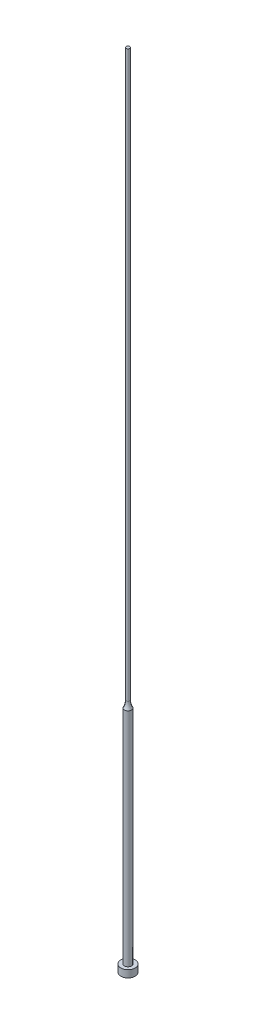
ISO-10303-21;
HEADER;
FILE_DESCRIPTION(('STEP AP214'),'2;1');
FILE_NAME('part.step','',(''),(''),'','','');
FILE_SCHEMA(('AUTOMOTIVE_DESIGN { 1 0 10303 214 1 1 1 1 }'));
ENDSEC;
DATA;
#1=APPLICATION_CONTEXT('core data for automotive mechanical design processes');
#2=APPLICATION_PROTOCOL_DEFINITION('international standard','automotive_design',2000,#1);
#3=PRODUCT_CONTEXT('',#1,'mechanical');
#4=PRODUCT('Part','Part','',(#3));
#5=PRODUCT_RELATED_PRODUCT_CATEGORY('part','',(#4));
#6=PRODUCT_DEFINITION_FORMATION('','',#4);
#7=PRODUCT_DEFINITION_CONTEXT('part definition',#1,'design');
#8=PRODUCT_DEFINITION('design','',#6,#7);
#9=PRODUCT_DEFINITION_SHAPE('','',#8);
#10=(LENGTH_UNIT() NAMED_UNIT(*) SI_UNIT(.MILLI.,.METRE.));
#11=(NAMED_UNIT(*) PLANE_ANGLE_UNIT() SI_UNIT($,.RADIAN.));
#12=(NAMED_UNIT(*) SI_UNIT($,.STERADIAN.) SOLID_ANGLE_UNIT());
#13=UNCERTAINTY_MEASURE_WITH_UNIT(LENGTH_MEASURE(1.E-05),#10,'distance_accuracy_value','');
#14=(GEOMETRIC_REPRESENTATION_CONTEXT(3) GLOBAL_UNCERTAINTY_ASSIGNED_CONTEXT((#13)) GLOBAL_UNIT_ASSIGNED_CONTEXT((#10,
#11,#12)) REPRESENTATION_CONTEXT('',''));
#15=CARTESIAN_POINT('',(0.,0.,0.));
#16=DIRECTION('',(0.,0.,1.));
#17=DIRECTION('',(1.,0.,0.));
#18=AXIS2_PLACEMENT_3D('',#15,#16,#17);
#19=CARTESIAN_POINT('',(0.,0.,0.));
#20=DIRECTION('',(0.,1.,0.));
#21=DIRECTION('',(-1.,0.,0.));
#22=AXIS2_PLACEMENT_3D('',#19,#20,#21);
#23=PLANE('',#22);
#24=CARTESIAN_POINT('',(0.,0.,0.));
#25=DIRECTION('',(0.,1.,0.));
#26=DIRECTION('',(-1.,0.,0.));
#27=AXIS2_PLACEMENT_3D('',#24,#25,#26);
#28=CIRCLE('',#27,3.175);
#29=CARTESIAN_POINT('',(-3.175,0.,0.));
#30=VERTEX_POINT('',#29);
#31=EDGE_CURVE('E37',#30,#30,#28,.T.);
#32=ORIENTED_EDGE('',*,*,#31,.F.);
#33=EDGE_LOOP('',(#32));
#34=FACE_BOUND('',#33,.T.);
#35=ADVANCED_FACE('F30',(#34),#23,.F.);
#36=CARTESIAN_POINT('',(0.,355.6,0.));
#37=DIRECTION('',(0.,1.,0.));
#38=DIRECTION('',(-1.,0.,0.));
#39=AXIS2_PLACEMENT_3D('',#36,#37,#38);
#40=CYLINDRICAL_SURFACE('',#39,3.175);
#41=CARTESIAN_POINT('',(0.,3.17499999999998,0.));
#42=DIRECTION('',(0.,1.,0.));
#43=DIRECTION('',(-1.,0.,0.));
#44=AXIS2_PLACEMENT_3D('',#41,#42,#43);
#45=CIRCLE('',#44,3.175);
#46=CARTESIAN_POINT('',(-3.175,3.17499999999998,0.));
#47=VERTEX_POINT('',#46);
#48=EDGE_CURVE('E41',#47,#47,#45,.T.);
#49=ORIENTED_EDGE('',*,*,#48,.F.);
#50=EDGE_LOOP('',(#49));
#51=FACE_BOUND('',#50,.T.);
#52=ORIENTED_EDGE('',*,*,#31,.T.);
#53=EDGE_LOOP('',(#52));
#54=FACE_BOUND('',#53,.T.);
#55=ADVANCED_FACE('F72',(#51,#54),#40,.T.);
#56=CARTESIAN_POINT('',(3.175,3.175,0.));
#57=DIRECTION('',(0.,-1.,0.));
#58=DIRECTION('',(1.,0.,0.));
#59=AXIS2_PLACEMENT_3D('',#56,#57,#58);
#60=PLANE('',#59);
#61=CARTESIAN_POINT('',(0.,3.17499999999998,0.));
#62=DIRECTION('',(0.,1.,0.));
#63=DIRECTION('',(-1.,0.,0.));
#64=AXIS2_PLACEMENT_3D('',#61,#62,#63);
#65=CIRCLE('',#64,1.58750000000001);
#66=CARTESIAN_POINT('',(-1.58750000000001,3.17499999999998,0.));
#67=VERTEX_POINT('',#66);
#68=EDGE_CURVE('E45',#67,#67,#65,.T.);
#69=ORIENTED_EDGE('',*,*,#68,.F.);
#70=EDGE_LOOP('',(#69));
#71=FACE_BOUND('',#70,.T.);
#72=ORIENTED_EDGE('',*,*,#48,.T.);
#73=EDGE_LOOP('',(#72));
#74=FACE_BOUND('',#73,.T.);
#75=ADVANCED_FACE('F68',(#71,#74),#60,.F.);
#76=CARTESIAN_POINT('',(0.,355.6,0.));
#77=DIRECTION('',(0.,1.,0.));
#78=DIRECTION('',(-1.,0.,0.));
#79=AXIS2_PLACEMENT_3D('',#76,#77,#78);
#80=CYLINDRICAL_SURFACE('',#79,1.58750000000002);
#81=CARTESIAN_POINT('',(0.,101.6,0.));
#82=DIRECTION('',(0.,1.,0.));
#83=DIRECTION('',(-1.,0.,0.));
#84=AXIS2_PLACEMENT_3D('',#81,#82,#83);
#85=CIRCLE('',#84,1.58750000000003);
#86=CARTESIAN_POINT('',(-1.58750000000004,101.6,0.));
#87=VERTEX_POINT('',#86);
#88=EDGE_CURVE('E50',#87,#87,#85,.T.);
#89=ORIENTED_EDGE('',*,*,#88,.F.);
#90=EDGE_LOOP('',(#89));
#91=FACE_BOUND('',#90,.T.);
#92=ORIENTED_EDGE('',*,*,#68,.T.);
#93=EDGE_LOOP('',(#92));
#94=FACE_BOUND('',#93,.T.);
#95=ADVANCED_FACE('F61',(#91,#94),#80,.T.);
#96=CARTESIAN_POINT('',(0.,355.6,0.));
#97=DIRECTION('',(0.,1.,0.));
#98=DIRECTION('',(-1.,0.,0.));
#99=AXIS2_PLACEMENT_3D('',#96,#97,#98);
#100=CYLINDRICAL_SURFACE('',#99,0.793750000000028);
#101=CARTESIAN_POINT('',(0.,104.674180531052,0.));
#102=DIRECTION('',(0.,-1.,0.));
#103=DIRECTION('',(1.,0.,0.));
#104=AXIS2_PLACEMENT_3D('',#101,#102,#103);
#105=CIRCLE('',#104,0.793750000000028);
#106=CARTESIAN_POINT('',(0.793750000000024,104.674180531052,0.));
#107=VERTEX_POINT('',#106);
#108=EDGE_CURVE('E10',#107,#107,#105,.F.);
#109=ORIENTED_EDGE('',*,*,#108,.T.);
#110=EDGE_LOOP('',(#109));
#111=FACE_BOUND('',#110,.T.);
#112=CARTESIAN_POINT('',(0.,355.6,0.));
#113=DIRECTION('',(0.,1.,0.));
#114=DIRECTION('',(-1.,0.,0.));
#115=AXIS2_PLACEMENT_3D('',#112,#113,#114);
#116=CIRCLE('',#115,0.793750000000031);
#117=CARTESIAN_POINT('',(-0.793750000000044,355.6,0.));
#118=VERTEX_POINT('',#117);
#119=EDGE_CURVE('E53',#118,#118,#116,.T.);
#120=ORIENTED_EDGE('',*,*,#119,.F.);
#121=EDGE_LOOP('',(#120));
#122=FACE_BOUND('',#121,.T.);
#123=ADVANCED_FACE('F59',(#111,#122),#100,.T.);
#124=CARTESIAN_POINT('',(0.793750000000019,355.6,0.));
#125=DIRECTION('',(0.,-1.,0.));
#126=DIRECTION('',(1.,0.,0.));
#127=AXIS2_PLACEMENT_3D('',#124,#125,#126);
#128=PLANE('',#127);
#129=ORIENTED_EDGE('',*,*,#119,.T.);
#130=EDGE_LOOP('',(#129));
#131=FACE_BOUND('',#130,.T.);
#132=ADVANCED_FACE('F57',(#131),#128,.F.);
#133=CARTESIAN_POINT('',(0.,104.674180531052,0.));
#134=DIRECTION('',(0.,-1.,0.));
#135=DIRECTION('',(1.,0.,0.));
#136=AXIS2_PLACEMENT_3D('',#133,#134,#135);
#137=TOROIDAL_SURFACE('',#136,7.14375000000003,6.35);
#138=ORIENTED_EDGE('',*,*,#88,.T.);
#139=EDGE_LOOP('',(#138));
#140=FACE_BOUND('',#139,.T.);
#141=ORIENTED_EDGE('',*,*,#108,.F.);
#142=EDGE_LOOP('',(#141));
#143=FACE_BOUND('',#142,.T.);
#144=ADVANCED_FACE('F32',(#140,#143),#137,.F.);
#145=CLOSED_SHELL('',(#35,#55,#75,#95,#123,#132,#144));
#146=MANIFOLD_SOLID_BREP('B2',#145);
#147=ADVANCED_BREP_SHAPE_REPRESENTATION('',(#18,#146),#14);
#148=SHAPE_DEFINITION_REPRESENTATION(#9,#147);
ENDSEC;
END-ISO-10303-21;
